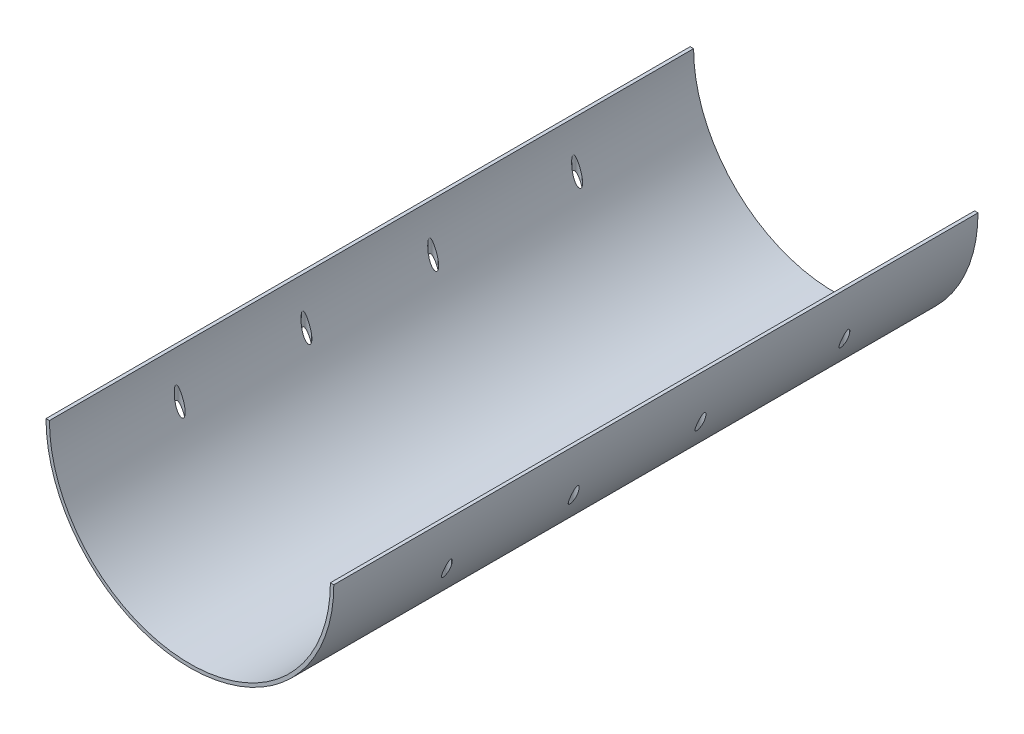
from build123d import *

# Parameters (mm, degrees)
BASE_EXTRUDE_DEPTH = 1193.8
SKETCH7_R          = 7.1755
CUT_EXTRUDE3_DEPTH = 1252.964943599


with BuildPart() as part:
    # Sketch1 → Base-Extrude (new body)
    with BuildSketch(Plane.XY):
        with BuildLine():
            Line((-266.7, 0), (-260.35, 0))
            ThreePointArc((-260.35, 0), (0, -260.35), (260.35, 0))
            Line((260.35, 0), (266.7, 0))
            ThreePointArc((266.7, 0), (0, -266.7), (-266.7, 0))
        make_face()
    extrude(amount=BASE_EXTRUDE_DEPTH)

    # Sketch7 → Cut-Extrude3 (cut, through all)
    with BuildSketch(Plane(origin=(0, 0, 0), x_dir=(1, 0, 0), z_dir=(0, 1, 0))):
        with Locations(Location((-247.65, -228.6, 0), (0, 0, 270))):
            Circle(SKETCH7_R)
        with Locations(Location((-247.65, -495.3, 0), (0, 0, 270))):
            Circle(SKETCH7_R)
        with Locations(Location((-247.65, -730.25, 0), (0, 0, 270))):
            Circle(SKETCH7_R)
        with Locations(Location((-247.475703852, -965.2, 0), (0, 0, 270))):
            Circle(SKETCH7_R)
    cut_extrude3 = extrude(amount=-CUT_EXTRUDE3_DEPTH, mode=Mode.SUBTRACT)

    # Mirror1: Cut-Extrude3 across plane
    add(cut_extrude3.mirror(Plane(origin=(0, 0, 0), x_dir=(0, 0, 1), z_dir=(1, 0, 0))), mode=Mode.SUBTRACT)


solid = part.part
